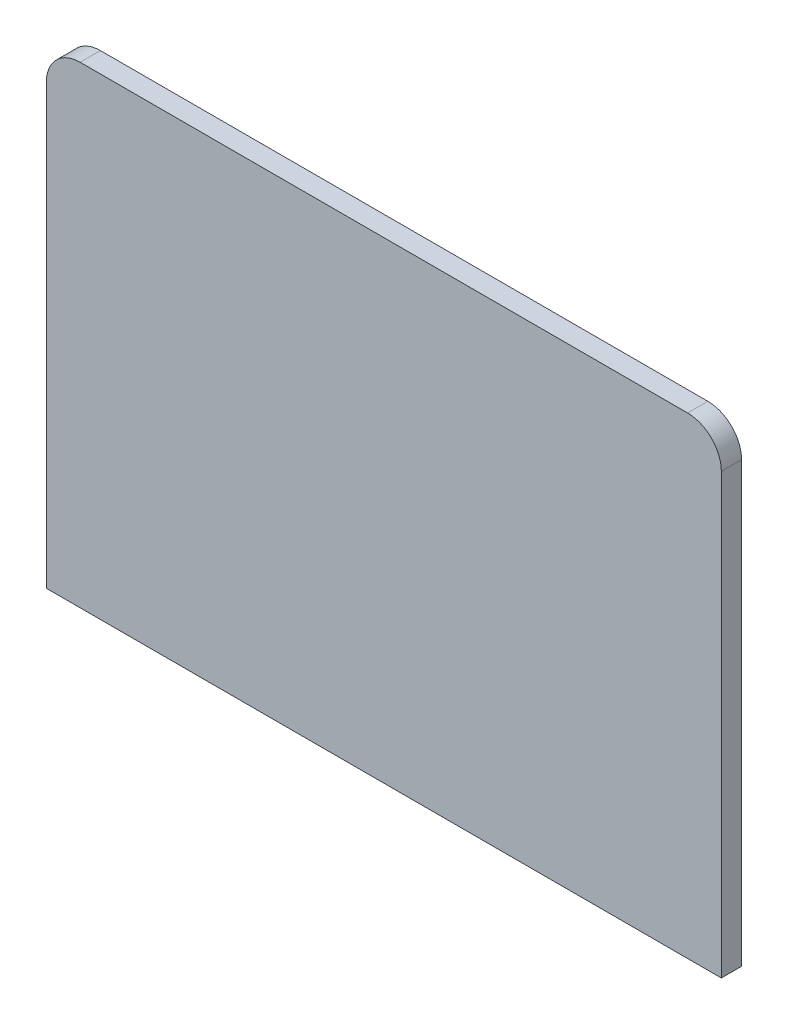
ISO-10303-21;
HEADER;
FILE_DESCRIPTION(('STEP AP214'),'2;1');
FILE_NAME('part.step','',(''),(''),'','','');
FILE_SCHEMA(('AUTOMOTIVE_DESIGN { 1 0 10303 214 1 1 1 1 }'));
ENDSEC;
DATA;
#1=APPLICATION_CONTEXT('core data for automotive mechanical design processes');
#2=APPLICATION_PROTOCOL_DEFINITION('international standard','automotive_design',2000,#1);
#3=PRODUCT_CONTEXT('',#1,'mechanical');
#4=PRODUCT('Part','Part','',(#3));
#5=PRODUCT_RELATED_PRODUCT_CATEGORY('part','',(#4));
#6=PRODUCT_DEFINITION_FORMATION('','',#4);
#7=PRODUCT_DEFINITION_CONTEXT('part definition',#1,'design');
#8=PRODUCT_DEFINITION('design','',#6,#7);
#9=PRODUCT_DEFINITION_SHAPE('','',#8);
#10=(LENGTH_UNIT() NAMED_UNIT(*) SI_UNIT(.MILLI.,.METRE.));
#11=(NAMED_UNIT(*) PLANE_ANGLE_UNIT() SI_UNIT($,.RADIAN.));
#12=(NAMED_UNIT(*) SI_UNIT($,.STERADIAN.) SOLID_ANGLE_UNIT());
#13=UNCERTAINTY_MEASURE_WITH_UNIT(LENGTH_MEASURE(1.E-05),#10,'distance_accuracy_value','');
#14=(GEOMETRIC_REPRESENTATION_CONTEXT(3) GLOBAL_UNCERTAINTY_ASSIGNED_CONTEXT((#13)) GLOBAL_UNIT_ASSIGNED_CONTEXT((#10,
#11,#12)) REPRESENTATION_CONTEXT('',''));
#15=CARTESIAN_POINT('',(0.,0.,0.));
#16=DIRECTION('',(0.,0.,1.));
#17=DIRECTION('',(1.,0.,0.));
#18=AXIS2_PLACEMENT_3D('',#15,#16,#17);
#19=CARTESIAN_POINT('',(334.612636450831,571.979218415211,3.00000000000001));
#20=DIRECTION('',(0.,0.,-1.));
#21=DIRECTION('',(-1.,0.,0.));
#22=AXIS2_PLACEMENT_3D('',#19,#20,#21);
#23=CYLINDRICAL_SURFACE('',#22,5.);
#24=CARTESIAN_POINT('',(334.612636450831,571.979218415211,0.));
#25=DIRECTION('',(0.,0.,1.));
#26=DIRECTION('',(1.,0.,0.));
#27=AXIS2_PLACEMENT_3D('',#24,#25,#26);
#28=CIRCLE('',#27,5.);
#29=CARTESIAN_POINT('',(334.612636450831,576.979218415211,0.));
#30=VERTEX_POINT('',#29);
#31=CARTESIAN_POINT('',(329.612636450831,571.979218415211,0.));
#32=VERTEX_POINT('',#31);
#33=EDGE_CURVE('E78',#30,#32,#28,.T.);
#34=ORIENTED_EDGE('',*,*,#33,.T.);
#35=DIRECTION('',(0.,0.,-1.));
#36=VECTOR('',#35,1.);
#37=CARTESIAN_POINT('',(329.612636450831,571.979218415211,3.00000000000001));
#38=LINE('',#37,#36);
#39=CARTESIAN_POINT('',(329.612636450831,571.979218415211,3.00000000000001));
#40=VERTEX_POINT('',#39);
#41=EDGE_CURVE('E11',#40,#32,#38,.T.);
#42=ORIENTED_EDGE('',*,*,#41,.F.);
#43=CARTESIAN_POINT('',(334.612636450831,571.979218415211,3.00000000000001));
#44=DIRECTION('',(0.,0.,1.));
#45=DIRECTION('',(1.,0.,0.));
#46=AXIS2_PLACEMENT_3D('',#43,#44,#45);
#47=CIRCLE('',#46,5.);
#48=CARTESIAN_POINT('',(334.612636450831,576.979218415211,3.00000000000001));
#49=VERTEX_POINT('',#48);
#50=EDGE_CURVE('E101',#49,#40,#47,.T.);
#51=ORIENTED_EDGE('',*,*,#50,.F.);
#52=DIRECTION('',(0.,0.,-1.));
#53=VECTOR('',#52,1.);
#54=CARTESIAN_POINT('',(334.612636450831,576.979218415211,3.00000000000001));
#55=LINE('',#54,#53);
#56=EDGE_CURVE('E91',#49,#30,#55,.T.);
#57=ORIENTED_EDGE('',*,*,#56,.T.);
#58=EDGE_LOOP('',(#34,#42,#51,#57));
#59=FACE_BOUND('',#58,.T.);
#60=ADVANCED_FACE('F22',(#59),#23,.T.);
#61=CARTESIAN_POINT('',(329.612636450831,571.979218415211,3.00000000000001));
#62=DIRECTION('',(1.,0.,0.));
#63=DIRECTION('',(0.,0.,-1.));
#64=AXIS2_PLACEMENT_3D('',#61,#62,#63);
#65=PLANE('',#64);
#66=DIRECTION('',(0.,-1.,0.));
#67=VECTOR('',#66,1.);
#68=CARTESIAN_POINT('',(329.612636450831,571.979218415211,0.));
#69=LINE('',#68,#67);
#70=CARTESIAN_POINT('',(329.612636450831,506.979218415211,0.));
#71=VERTEX_POINT('',#70);
#72=EDGE_CURVE('E74',#32,#71,#69,.T.);
#73=ORIENTED_EDGE('',*,*,#72,.T.);
#74=DIRECTION('',(0.,0.,-1.));
#75=VECTOR('',#74,1.);
#76=CARTESIAN_POINT('',(329.612636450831,506.979218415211,3.00000000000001));
#77=LINE('',#76,#75);
#78=CARTESIAN_POINT('',(329.612636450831,506.979218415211,3.00000000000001));
#79=VERTEX_POINT('',#78);
#80=EDGE_CURVE('E29',#79,#71,#77,.T.);
#81=ORIENTED_EDGE('',*,*,#80,.F.);
#82=DIRECTION('',(0.,-1.,0.));
#83=VECTOR('',#82,1.);
#84=CARTESIAN_POINT('',(329.612636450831,571.979218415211,3.00000000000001));
#85=LINE('',#84,#83);
#86=EDGE_CURVE('E87',#40,#79,#85,.T.);
#87=ORIENTED_EDGE('',*,*,#86,.F.);
#88=ORIENTED_EDGE('',*,*,#41,.T.);
#89=EDGE_LOOP('',(#73,#81,#87,#88));
#90=FACE_BOUND('',#89,.T.);
#91=ADVANCED_FACE('F86',(#90),#65,.F.);
#92=CARTESIAN_POINT('',(329.612636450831,506.979218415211,3.00000000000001));
#93=DIRECTION('',(0.,1.,0.));
#94=DIRECTION('',(0.,0.,1.));
#95=AXIS2_PLACEMENT_3D('',#92,#93,#94);
#96=PLANE('',#95);
#97=DIRECTION('',(1.,0.,0.));
#98=VECTOR('',#97,1.);
#99=CARTESIAN_POINT('',(329.612636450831,506.979218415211,0.));
#100=LINE('',#99,#98);
#101=CARTESIAN_POINT('',(429.612636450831,506.979218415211,0.));
#102=VERTEX_POINT('',#101);
#103=EDGE_CURVE('E80',#71,#102,#100,.T.);
#104=ORIENTED_EDGE('',*,*,#103,.T.);
#105=DIRECTION('',(0.,0.,-1.));
#106=VECTOR('',#105,1.);
#107=CARTESIAN_POINT('',(429.612636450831,506.979218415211,3.00000000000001));
#108=LINE('',#107,#106);
#109=CARTESIAN_POINT('',(429.612636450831,506.979218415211,3.00000000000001));
#110=VERTEX_POINT('',#109);
#111=EDGE_CURVE('E117',#110,#102,#108,.T.);
#112=ORIENTED_EDGE('',*,*,#111,.F.);
#113=DIRECTION('',(1.,0.,0.));
#114=VECTOR('',#113,1.);
#115=CARTESIAN_POINT('',(329.612636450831,506.979218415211,3.00000000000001));
#116=LINE('',#115,#114);
#117=EDGE_CURVE('E104',#79,#110,#116,.T.);
#118=ORIENTED_EDGE('',*,*,#117,.F.);
#119=ORIENTED_EDGE('',*,*,#80,.T.);
#120=EDGE_LOOP('',(#104,#112,#118,#119));
#121=FACE_BOUND('',#120,.T.);
#122=ADVANCED_FACE('F121',(#121),#96,.F.);
#123=CARTESIAN_POINT('',(429.612636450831,571.979218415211,3.00000000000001));
#124=DIRECTION('',(-1.,0.,0.));
#125=DIRECTION('',(0.,0.,1.));
#126=AXIS2_PLACEMENT_3D('',#123,#124,#125);
#127=PLANE('',#126);
#128=DIRECTION('',(0.,1.,0.));
#129=VECTOR('',#128,1.);
#130=CARTESIAN_POINT('',(429.612636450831,571.979218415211,0.));
#131=LINE('',#130,#129);
#132=CARTESIAN_POINT('',(429.612636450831,571.979218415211,0.));
#133=VERTEX_POINT('',#132);
#134=EDGE_CURVE('E95',#102,#133,#131,.T.);
#135=ORIENTED_EDGE('',*,*,#134,.T.);
#136=DIRECTION('',(0.,0.,-1.));
#137=VECTOR('',#136,1.);
#138=CARTESIAN_POINT('',(429.612636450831,571.979218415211,3.00000000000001));
#139=LINE('',#138,#137);
#140=CARTESIAN_POINT('',(429.612636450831,571.979218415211,3.00000000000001));
#141=VERTEX_POINT('',#140);
#142=EDGE_CURVE('E114',#141,#133,#139,.T.);
#143=ORIENTED_EDGE('',*,*,#142,.F.);
#144=DIRECTION('',(0.,1.,0.));
#145=VECTOR('',#144,1.);
#146=CARTESIAN_POINT('',(429.612636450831,571.979218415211,3.00000000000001));
#147=LINE('',#146,#145);
#148=EDGE_CURVE('E106',#110,#141,#147,.T.);
#149=ORIENTED_EDGE('',*,*,#148,.F.);
#150=ORIENTED_EDGE('',*,*,#111,.T.);
#151=EDGE_LOOP('',(#135,#143,#149,#150));
#152=FACE_BOUND('',#151,.T.);
#153=ADVANCED_FACE('F127',(#152),#127,.F.);
#154=CARTESIAN_POINT('',(424.612636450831,571.979218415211,3.00000000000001));
#155=DIRECTION('',(0.,0.,-1.));
#156=DIRECTION('',(-1.,0.,0.));
#157=AXIS2_PLACEMENT_3D('',#154,#155,#156);
#158=CYLINDRICAL_SURFACE('',#157,5.);
#159=CARTESIAN_POINT('',(424.612636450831,571.979218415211,0.));
#160=DIRECTION('',(0.,0.,1.));
#161=DIRECTION('',(1.,0.,0.));
#162=AXIS2_PLACEMENT_3D('',#159,#160,#161);
#163=CIRCLE('',#162,5.);
#164=CARTESIAN_POINT('',(424.612636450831,576.979218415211,0.));
#165=VERTEX_POINT('',#164);
#166=EDGE_CURVE('E97',#133,#165,#163,.T.);
#167=ORIENTED_EDGE('',*,*,#166,.T.);
#168=DIRECTION('',(0.,0.,-1.));
#169=VECTOR('',#168,1.);
#170=CARTESIAN_POINT('',(424.612636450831,576.979218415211,3.00000000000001));
#171=LINE('',#170,#169);
#172=CARTESIAN_POINT('',(424.612636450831,576.979218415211,3.00000000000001));
#173=VERTEX_POINT('',#172);
#174=EDGE_CURVE('E111',#173,#165,#171,.T.);
#175=ORIENTED_EDGE('',*,*,#174,.F.);
#176=CARTESIAN_POINT('',(424.612636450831,571.979218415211,3.00000000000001));
#177=DIRECTION('',(0.,0.,1.));
#178=DIRECTION('',(1.,0.,0.));
#179=AXIS2_PLACEMENT_3D('',#176,#177,#178);
#180=CIRCLE('',#179,5.);
#181=EDGE_CURVE('E41',#141,#173,#180,.T.);
#182=ORIENTED_EDGE('',*,*,#181,.F.);
#183=ORIENTED_EDGE('',*,*,#142,.T.);
#184=EDGE_LOOP('',(#167,#175,#182,#183));
#185=FACE_BOUND('',#184,.T.);
#186=ADVANCED_FACE('F130',(#185),#158,.T.);
#187=CARTESIAN_POINT('',(334.612636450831,576.979218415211,3.00000000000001));
#188=DIRECTION('',(0.,-1.,0.));
#189=DIRECTION('',(0.,0.,-1.));
#190=AXIS2_PLACEMENT_3D('',#187,#188,#189);
#191=PLANE('',#190);
#192=DIRECTION('',(-1.,0.,0.));
#193=VECTOR('',#192,1.);
#194=CARTESIAN_POINT('',(334.612636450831,576.979218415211,0.));
#195=LINE('',#194,#193);
#196=EDGE_CURVE('E99',#165,#30,#195,.T.);
#197=ORIENTED_EDGE('',*,*,#196,.T.);
#198=ORIENTED_EDGE('',*,*,#56,.F.);
#199=DIRECTION('',(-1.,0.,0.));
#200=VECTOR('',#199,1.);
#201=CARTESIAN_POINT('',(334.612636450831,576.979218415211,3.00000000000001));
#202=LINE('',#201,#200);
#203=EDGE_CURVE('E36',#173,#49,#202,.T.);
#204=ORIENTED_EDGE('',*,*,#203,.F.);
#205=ORIENTED_EDGE('',*,*,#174,.T.);
#206=EDGE_LOOP('',(#197,#198,#204,#205));
#207=FACE_BOUND('',#206,.T.);
#208=ADVANCED_FACE('F132',(#207),#191,.F.);
#209=CARTESIAN_POINT('',(334.612636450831,571.979218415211,3.00000000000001));
#210=DIRECTION('',(0.,0.,1.));
#211=DIRECTION('',(1.,0.,0.));
#212=AXIS2_PLACEMENT_3D('',#209,#210,#211);
#213=PLANE('',#212);
#214=ORIENTED_EDGE('',*,*,#50,.T.);
#215=ORIENTED_EDGE('',*,*,#86,.T.);
#216=ORIENTED_EDGE('',*,*,#117,.T.);
#217=ORIENTED_EDGE('',*,*,#148,.T.);
#218=ORIENTED_EDGE('',*,*,#181,.T.);
#219=ORIENTED_EDGE('',*,*,#203,.T.);
#220=EDGE_LOOP('',(#214,#215,#216,#217,#218,#219));
#221=FACE_BOUND('',#220,.T.);
#222=ADVANCED_FACE('F124',(#221),#213,.T.);
#223=CARTESIAN_POINT('',(334.612636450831,571.979218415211,0.));
#224=DIRECTION('',(0.,0.,1.));
#225=DIRECTION('',(1.,0.,0.));
#226=AXIS2_PLACEMENT_3D('',#223,#224,#225);
#227=PLANE('',#226);
#228=ORIENTED_EDGE('',*,*,#33,.F.);
#229=ORIENTED_EDGE('',*,*,#196,.F.);
#230=ORIENTED_EDGE('',*,*,#166,.F.);
#231=ORIENTED_EDGE('',*,*,#134,.F.);
#232=ORIENTED_EDGE('',*,*,#103,.F.);
#233=ORIENTED_EDGE('',*,*,#72,.F.);
#234=EDGE_LOOP('',(#228,#229,#230,#231,#232,#233));
#235=FACE_BOUND('',#234,.T.);
#236=ADVANCED_FACE('F75',(#235),#227,.F.);
#237=CLOSED_SHELL('',(#60,#91,#122,#153,#186,#208,#222,#236));
#238=MANIFOLD_SOLID_BREP('B2',#237);
#239=ADVANCED_BREP_SHAPE_REPRESENTATION('',(#18,#238),#14);
#240=SHAPE_DEFINITION_REPRESENTATION(#9,#239);
ENDSEC;
END-ISO-10303-21;
